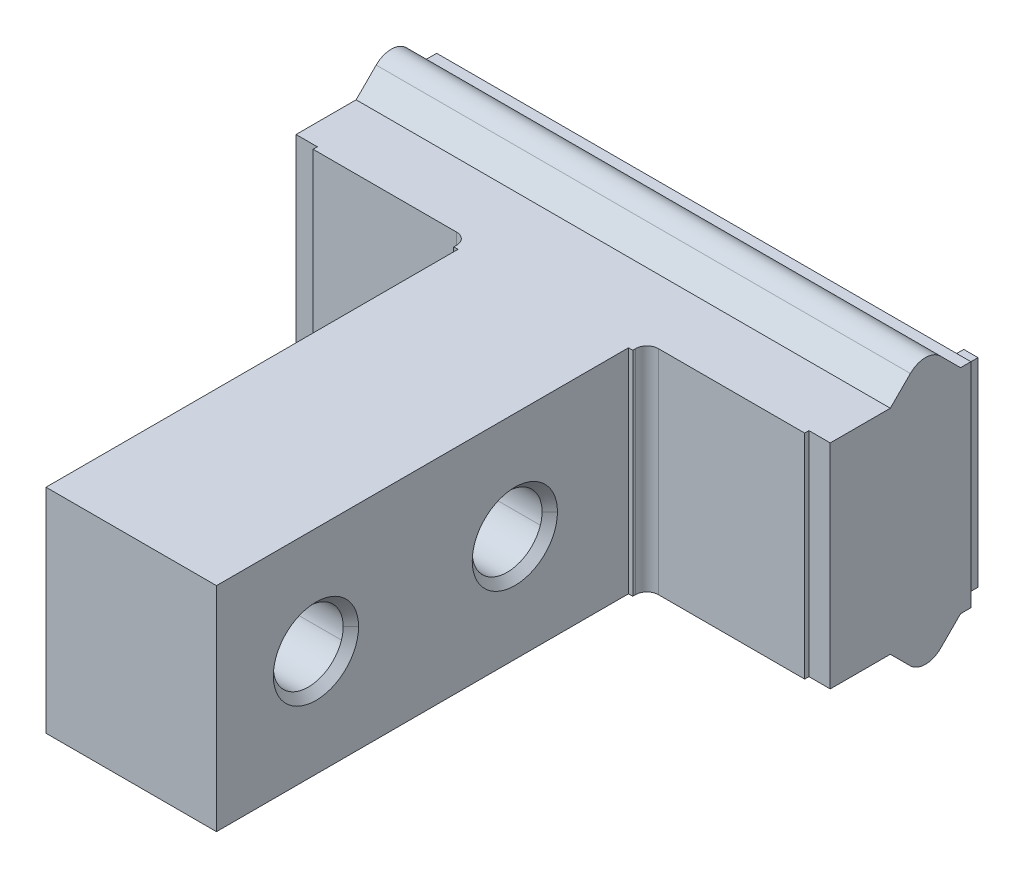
ISO-10303-21;
HEADER;
FILE_DESCRIPTION(('STEP AP214'),'2;1');
FILE_NAME('part.step','',(''),(''),'','','');
FILE_SCHEMA(('AUTOMOTIVE_DESIGN { 1 0 10303 214 1 1 1 1 }'));
ENDSEC;
DATA;
#1=APPLICATION_CONTEXT('core data for automotive mechanical design processes');
#2=APPLICATION_PROTOCOL_DEFINITION('international standard','automotive_design',2000,#1);
#3=PRODUCT_CONTEXT('',#1,'mechanical');
#4=PRODUCT('Part','Part','',(#3));
#5=PRODUCT_RELATED_PRODUCT_CATEGORY('part','',(#4));
#6=PRODUCT_DEFINITION_FORMATION('','',#4);
#7=PRODUCT_DEFINITION_CONTEXT('part definition',#1,'design');
#8=PRODUCT_DEFINITION('design','',#6,#7);
#9=PRODUCT_DEFINITION_SHAPE('','',#8);
#10=(LENGTH_UNIT() NAMED_UNIT(*) SI_UNIT(.MILLI.,.METRE.));
#11=(NAMED_UNIT(*) PLANE_ANGLE_UNIT() SI_UNIT($,.RADIAN.));
#12=(NAMED_UNIT(*) SI_UNIT($,.STERADIAN.) SOLID_ANGLE_UNIT());
#13=UNCERTAINTY_MEASURE_WITH_UNIT(LENGTH_MEASURE(1.E-05),#10,'distance_accuracy_value','');
#14=(GEOMETRIC_REPRESENTATION_CONTEXT(3) GLOBAL_UNCERTAINTY_ASSIGNED_CONTEXT((#13)) GLOBAL_UNIT_ASSIGNED_CONTEXT((#10,
#11,#12)) REPRESENTATION_CONTEXT('',''));
#15=CARTESIAN_POINT('',(0.,0.,0.));
#16=DIRECTION('',(0.,0.,1.));
#17=DIRECTION('',(1.,0.,0.));
#18=AXIS2_PLACEMENT_3D('',#15,#16,#17);
#19=CARTESIAN_POINT('',(-37.1000000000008,7.5,11.0000000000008));
#20=DIRECTION('',(0.,1.,0.));
#21=DIRECTION('',(0.,0.,1.));
#22=AXIS2_PLACEMENT_3D('',#19,#20,#21);
#23=PLANE('',#22);
#24=DIRECTION('',(-1.,0.,0.));
#25=VECTOR('',#24,1.);
#26=CARTESIAN_POINT('',(-11.1,7.5,9.9));
#27=LINE('',#26,#25);
#28=CARTESIAN_POINT('',(-47.2,7.5,9.9));
#29=VERTEX_POINT('',#28);
#30=CARTESIAN_POINT('',(-48.7,7.5,9.9));
#31=VERTEX_POINT('',#30);
#32=EDGE_CURVE('E11',#29,#31,#27,.T.);
#33=ORIENTED_EDGE('',*,*,#32,.F.);
#34=DIRECTION('',(0.,0.,1.));
#35=VECTOR('',#34,1.);
#36=CARTESIAN_POINT('',(-47.2,7.5,11.0000000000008));
#37=LINE('',#36,#35);
#38=CARTESIAN_POINT('',(-47.2,7.5,10.2));
#39=VERTEX_POINT('',#38);
#40=EDGE_CURVE('E25',#29,#39,#37,.T.);
#41=ORIENTED_EDGE('',*,*,#40,.T.);
#42=DIRECTION('',(1.,0.,0.));
#43=VECTOR('',#42,1.);
#44=CARTESIAN_POINT('',(-48.7,7.5,10.2));
#45=LINE('',#44,#43);
#46=CARTESIAN_POINT('',(-37.1,7.5,10.2));
#47=VERTEX_POINT('',#46);
#48=EDGE_CURVE('E831',#39,#47,#45,.T.);
#49=ORIENTED_EDGE('',*,*,#48,.T.);
#50=CARTESIAN_POINT('',(-37.1000000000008,7.5,11.0000000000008));
#51=DIRECTION('',(0.,1.,0.));
#52=DIRECTION('',(1.,0.,0.));
#53=AXIS2_PLACEMENT_3D('',#50,#51,#52);
#54=CIRCLE('',#53,0.800000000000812);
#55=CARTESIAN_POINT('',(-36.3,7.5,11.));
#56=VERTEX_POINT('',#55);
#57=EDGE_CURVE('E826',#56,#47,#54,.T.);
#58=ORIENTED_EDGE('',*,*,#57,.F.);
#59=DIRECTION('',(0.,0.,1.));
#60=VECTOR('',#59,1.);
#61=CARTESIAN_POINT('',(-36.3,7.5,11.));
#62=LINE('',#61,#60);
#63=CARTESIAN_POINT('',(-36.3,7.5,11.2));
#64=VERTEX_POINT('',#63);
#65=EDGE_CURVE('E822',#56,#64,#62,.T.);
#66=ORIENTED_EDGE('',*,*,#65,.T.);
#67=DIRECTION('',(1.,0.,0.));
#68=VECTOR('',#67,1.);
#69=CARTESIAN_POINT('',(-36.3,7.5,11.2));
#70=LINE('',#69,#68);
#71=CARTESIAN_POINT('',(-36.,7.5,11.2));
#72=VERTEX_POINT('',#71);
#73=EDGE_CURVE('E818',#64,#72,#70,.T.);
#74=ORIENTED_EDGE('',*,*,#73,.T.);
#75=DIRECTION('',(0.,0.,1.));
#76=VECTOR('',#75,1.);
#77=CARTESIAN_POINT('',(-36.,7.5,11.2));
#78=LINE('',#77,#76);
#79=CARTESIAN_POINT('',(-36.,7.5,40.2));
#80=VERTEX_POINT('',#79);
#81=EDGE_CURVE('E814',#72,#80,#78,.T.);
#82=ORIENTED_EDGE('',*,*,#81,.T.);
#83=DIRECTION('',(1.,0.,0.));
#84=VECTOR('',#83,1.);
#85=CARTESIAN_POINT('',(-36.,7.5,40.2));
#86=LINE('',#85,#84);
#87=CARTESIAN_POINT('',(-24.,7.5,40.2));
#88=VERTEX_POINT('',#87);
#89=EDGE_CURVE('E810',#80,#88,#86,.T.);
#90=ORIENTED_EDGE('',*,*,#89,.T.);
#91=DIRECTION('',(0.,0.,-1.));
#92=VECTOR('',#91,1.);
#93=CARTESIAN_POINT('',(-24.,7.5,40.2));
#94=LINE('',#93,#92);
#95=CARTESIAN_POINT('',(-24.,7.5,11.2));
#96=VERTEX_POINT('',#95);
#97=EDGE_CURVE('E806',#88,#96,#94,.T.);
#98=ORIENTED_EDGE('',*,*,#97,.T.);
#99=DIRECTION('',(1.,0.,0.));
#100=VECTOR('',#99,1.);
#101=CARTESIAN_POINT('',(-24.,7.5,11.2));
#102=LINE('',#101,#100);
#103=CARTESIAN_POINT('',(-23.7,7.5,11.2));
#104=VERTEX_POINT('',#103);
#105=EDGE_CURVE('E802',#96,#104,#102,.T.);
#106=ORIENTED_EDGE('',*,*,#105,.T.);
#107=DIRECTION('',(0.,0.,-1.));
#108=VECTOR('',#107,1.);
#109=CARTESIAN_POINT('',(-23.7,7.5,11.2));
#110=LINE('',#109,#108);
#111=CARTESIAN_POINT('',(-23.7,7.5,11.));
#112=VERTEX_POINT('',#111);
#113=EDGE_CURVE('E798',#104,#112,#110,.T.);
#114=ORIENTED_EDGE('',*,*,#113,.T.);
#115=CARTESIAN_POINT('',(-22.8999999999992,7.5,11.0000000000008));
#116=DIRECTION('',(0.,1.,0.));
#117=DIRECTION('',(1.,0.,0.));
#118=AXIS2_PLACEMENT_3D('',#115,#116,#117);
#119=CIRCLE('',#118,0.800000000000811);
#120=CARTESIAN_POINT('',(-22.9,7.5,10.2));
#121=VERTEX_POINT('',#120);
#122=EDGE_CURVE('E793',#121,#112,#119,.T.);
#123=ORIENTED_EDGE('',*,*,#122,.F.);
#124=DIRECTION('',(1.,0.,0.));
#125=VECTOR('',#124,1.);
#126=CARTESIAN_POINT('',(-22.9,7.5,10.2));
#127=LINE('',#126,#125);
#128=CARTESIAN_POINT('',(-12.6,7.5,10.2));
#129=VERTEX_POINT('',#128);
#130=EDGE_CURVE('E789',#121,#129,#127,.T.);
#131=ORIENTED_EDGE('',*,*,#130,.T.);
#132=DIRECTION('',(0.,0.,-1.));
#133=VECTOR('',#132,1.);
#134=CARTESIAN_POINT('',(-12.6,7.5,11.0000000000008));
#135=LINE('',#134,#133);
#136=CARTESIAN_POINT('',(-12.6,7.5,9.9));
#137=VERTEX_POINT('',#136);
#138=EDGE_CURVE('E785',#129,#137,#135,.T.);
#139=ORIENTED_EDGE('',*,*,#138,.T.);
#140=DIRECTION('',(-1.,0.,0.));
#141=VECTOR('',#140,1.);
#142=CARTESIAN_POINT('',(-11.1,7.5,9.9));
#143=LINE('',#142,#141);
#144=CARTESIAN_POINT('',(-11.1,7.5,9.9));
#145=VERTEX_POINT('',#144);
#146=EDGE_CURVE('E780',#145,#137,#143,.T.);
#147=ORIENTED_EDGE('',*,*,#146,.F.);
#148=DIRECTION('',(0.,0.,1.));
#149=VECTOR('',#148,1.);
#150=CARTESIAN_POINT('',(-11.1,7.5,5.6723));
#151=LINE('',#150,#149);
#152=CARTESIAN_POINT('',(-11.1,7.5,5.6723));
#153=VERTEX_POINT('',#152);
#154=EDGE_CURVE('E775',#153,#145,#151,.T.);
#155=ORIENTED_EDGE('',*,*,#154,.F.);
#156=DIRECTION('',(-1.,0.,0.));
#157=VECTOR('',#156,1.);
#158=CARTESIAN_POINT('',(-11.1,7.5,5.6723));
#159=LINE('',#158,#157);
#160=CARTESIAN_POINT('',(-48.7,7.5,5.6723));
#161=VERTEX_POINT('',#160);
#162=EDGE_CURVE('E771',#153,#161,#159,.T.);
#163=ORIENTED_EDGE('',*,*,#162,.T.);
#164=DIRECTION('',(0.,0.,1.));
#165=VECTOR('',#164,1.);
#166=CARTESIAN_POINT('',(-48.7,7.5,5.6723));
#167=LINE('',#166,#165);
#168=EDGE_CURVE('E767',#161,#31,#167,.T.);
#169=ORIENTED_EDGE('',*,*,#168,.T.);
#170=EDGE_LOOP('',(#33,#41,#49,#58,#66,#74,#82,#90,#98,#106,#114,#123,#131,#139,#147,#155,#163,#169));
#171=FACE_BOUND('',#170,.T.);
#172=ADVANCED_FACE('F17',(#171),#23,.T.);
#173=CARTESIAN_POINT('',(-48.7,-7.85,3.1995));
#174=DIRECTION('',(1.,0.,0.));
#175=DIRECTION('',(0.,0.,-1.));
#176=AXIS2_PLACEMENT_3D('',#173,#174,#175);
#177=PLANE('',#176);
#178=ORIENTED_EDGE('',*,*,#168,.F.);
#179=DIRECTION('',(0.,-0.706736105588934,0.707477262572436));
#180=VECTOR('',#179,1.);
#181=CARTESIAN_POINT('',(-48.7,8.9112158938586,4.2596041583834));
#182=LINE('',#181,#180);
#183=CARTESIAN_POINT('',(-48.7,8.9112158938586,4.2596041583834));
#184=VERTEX_POINT('',#183);
#185=EDGE_CURVE('E762',#184,#161,#182,.T.);
#186=ORIENTED_EDGE('',*,*,#185,.F.);
#187=CARTESIAN_POINT('',(-48.7,7.85,3.1995));
#188=DIRECTION('',(1.,0.,0.));
#189=DIRECTION('',(0.,0.,-1.));
#190=AXIS2_PLACEMENT_3D('',#187,#188,#189);
#191=CIRCLE('',#190,1.49999999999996);
#192=CARTESIAN_POINT('',(-48.7,8.9106901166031,2.1388697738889));
#193=VERTEX_POINT('',#192);
#194=EDGE_CURVE('E757',#193,#184,#191,.T.);
#195=ORIENTED_EDGE('',*,*,#194,.F.);
#196=DIRECTION('',(0.,0.707086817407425,0.707126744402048));
#197=VECTOR('',#196,1.);
#198=CARTESIAN_POINT('',(-48.7,7.5,0.7281));
#199=LINE('',#198,#197);
#200=CARTESIAN_POINT('',(-48.7,7.5,0.7281));
#201=VERTEX_POINT('',#200);
#202=EDGE_CURVE('E752',#201,#193,#199,.T.);
#203=ORIENTED_EDGE('',*,*,#202,.F.);
#204=DIRECTION('',(0.,0.,1.));
#205=VECTOR('',#204,1.);
#206=CARTESIAN_POINT('',(-48.7,7.5,0.));
#207=LINE('',#206,#205);
#208=CARTESIAN_POINT('',(-48.7,7.5,0.));
#209=VERTEX_POINT('',#208);
#210=EDGE_CURVE('E747',#209,#201,#207,.T.);
#211=ORIENTED_EDGE('',*,*,#210,.F.);
#212=DIRECTION('',(0.,1.,0.));
#213=VECTOR('',#212,1.);
#214=CARTESIAN_POINT('',(-48.7,-7.5,0.));
#215=LINE('',#214,#213);
#216=CARTESIAN_POINT('',(-48.7,-7.5,0.));
#217=VERTEX_POINT('',#216);
#218=EDGE_CURVE('E742',#217,#209,#215,.T.);
#219=ORIENTED_EDGE('',*,*,#218,.F.);
#220=DIRECTION('',(0.,0.,-1.));
#221=VECTOR('',#220,1.);
#222=CARTESIAN_POINT('',(-48.7,-7.5,0.72809999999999));
#223=LINE('',#222,#221);
#224=CARTESIAN_POINT('',(-48.7,-7.5,0.72809999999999));
#225=VERTEX_POINT('',#224);
#226=EDGE_CURVE('E737',#225,#217,#223,.T.);
#227=ORIENTED_EDGE('',*,*,#226,.F.);
#228=DIRECTION('',(0.,0.707086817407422,-0.70712674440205));
#229=VECTOR('',#228,1.);
#230=CARTESIAN_POINT('',(-48.7,-8.9106901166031,2.1388697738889));
#231=LINE('',#230,#229);
#232=CARTESIAN_POINT('',(-48.7,-8.9106901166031,2.1388697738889));
#233=VERTEX_POINT('',#232);
#234=EDGE_CURVE('E732',#233,#225,#231,.T.);
#235=ORIENTED_EDGE('',*,*,#234,.F.);
#236=CARTESIAN_POINT('',(-48.7,-7.85,3.1995));
#237=DIRECTION('',(1.,0.,0.));
#238=DIRECTION('',(0.,0.,-1.));
#239=AXIS2_PLACEMENT_3D('',#236,#237,#238);
#240=CIRCLE('',#239,1.49999999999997);
#241=CARTESIAN_POINT('',(-48.7,-8.9112158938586,4.2596041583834));
#242=VERTEX_POINT('',#241);
#243=EDGE_CURVE('E727',#242,#233,#240,.T.);
#244=ORIENTED_EDGE('',*,*,#243,.F.);
#245=DIRECTION('',(0.,-0.706736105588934,-0.707477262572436));
#246=VECTOR('',#245,1.);
#247=CARTESIAN_POINT('',(-48.7,-7.5,5.6723));
#248=LINE('',#247,#246);
#249=CARTESIAN_POINT('',(-48.7,-7.5,5.6723));
#250=VERTEX_POINT('',#249);
#251=EDGE_CURVE('E722',#250,#242,#248,.T.);
#252=ORIENTED_EDGE('',*,*,#251,.F.);
#253=DIRECTION('',(0.,0.,-1.));
#254=VECTOR('',#253,1.);
#255=CARTESIAN_POINT('',(-48.7,-7.5,9.9));
#256=LINE('',#255,#254);
#257=CARTESIAN_POINT('',(-48.7,-7.5,9.9));
#258=VERTEX_POINT('',#257);
#259=EDGE_CURVE('E717',#258,#250,#256,.T.);
#260=ORIENTED_EDGE('',*,*,#259,.F.);
#261=DIRECTION('',(0.,-1.,0.));
#262=VECTOR('',#261,1.);
#263=CARTESIAN_POINT('',(-48.7,7.5,9.9));
#264=LINE('',#263,#262);
#265=EDGE_CURVE('E712',#31,#258,#264,.T.);
#266=ORIENTED_EDGE('',*,*,#265,.F.);
#267=EDGE_LOOP('',(#178,#186,#195,#203,#211,#219,#227,#235,#244,#252,#260,#266));
#268=FACE_BOUND('',#267,.T.);
#269=ADVANCED_FACE('F903',(#268),#177,.F.);
#270=CARTESIAN_POINT('',(-11.1,7.5,9.9));
#271=DIRECTION('',(0.,0.,-1.));
#272=DIRECTION('',(-1.,0.,0.));
#273=AXIS2_PLACEMENT_3D('',#270,#271,#272);
#274=PLANE('',#273);
#275=DIRECTION('',(0.,-1.,0.));
#276=VECTOR('',#275,1.);
#277=CARTESIAN_POINT('',(-47.2,50.,9.9));
#278=LINE('',#277,#276);
#279=CARTESIAN_POINT('',(-47.2,-7.5,9.9));
#280=VERTEX_POINT('',#279);
#281=EDGE_CURVE('E707',#29,#280,#278,.T.);
#282=ORIENTED_EDGE('',*,*,#281,.F.);
#283=ORIENTED_EDGE('',*,*,#32,.T.);
#284=ORIENTED_EDGE('',*,*,#265,.T.);
#285=DIRECTION('',(-1.,0.,0.));
#286=VECTOR('',#285,1.);
#287=CARTESIAN_POINT('',(-11.1,-7.5,9.9));
#288=LINE('',#287,#286);
#289=EDGE_CURVE('E702',#280,#258,#288,.T.);
#290=ORIENTED_EDGE('',*,*,#289,.F.);
#291=EDGE_LOOP('',(#282,#283,#284,#290));
#292=FACE_BOUND('',#291,.T.);
#293=ADVANCED_FACE('F905',(#292),#274,.F.);
#294=CARTESIAN_POINT('',(-37.1000000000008,-7.5,11.0000000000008));
#295=DIRECTION('',(0.,1.,0.));
#296=DIRECTION('',(0.,0.,1.));
#297=AXIS2_PLACEMENT_3D('',#294,#295,#296);
#298=PLANE('',#297);
#299=ORIENTED_EDGE('',*,*,#259,.T.);
#300=DIRECTION('',(-1.,0.,0.));
#301=VECTOR('',#300,1.);
#302=CARTESIAN_POINT('',(-11.1,-7.5,5.6723));
#303=LINE('',#302,#301);
#304=CARTESIAN_POINT('',(-11.1,-7.5,5.6723));
#305=VERTEX_POINT('',#304);
#306=EDGE_CURVE('E697',#305,#250,#303,.T.);
#307=ORIENTED_EDGE('',*,*,#306,.F.);
#308=DIRECTION('',(0.,0.,-1.));
#309=VECTOR('',#308,1.);
#310=CARTESIAN_POINT('',(-11.1,-7.5,9.9));
#311=LINE('',#310,#309);
#312=CARTESIAN_POINT('',(-11.1,-7.5,9.9));
#313=VERTEX_POINT('',#312);
#314=EDGE_CURVE('E692',#313,#305,#311,.T.);
#315=ORIENTED_EDGE('',*,*,#314,.F.);
#316=DIRECTION('',(-1.,0.,0.));
#317=VECTOR('',#316,1.);
#318=CARTESIAN_POINT('',(-11.1,-7.5,9.9));
#319=LINE('',#318,#317);
#320=CARTESIAN_POINT('',(-12.6,-7.5,9.9));
#321=VERTEX_POINT('',#320);
#322=EDGE_CURVE('E688',#313,#321,#319,.T.);
#323=ORIENTED_EDGE('',*,*,#322,.T.);
#324=DIRECTION('',(0.,0.,-1.));
#325=VECTOR('',#324,1.);
#326=CARTESIAN_POINT('',(-12.6,-7.5,11.0000000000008));
#327=LINE('',#326,#325);
#328=CARTESIAN_POINT('',(-12.6,-7.5,10.2));
#329=VERTEX_POINT('',#328);
#330=EDGE_CURVE('E683',#329,#321,#327,.T.);
#331=ORIENTED_EDGE('',*,*,#330,.F.);
#332=DIRECTION('',(1.,0.,0.));
#333=VECTOR('',#332,1.);
#334=CARTESIAN_POINT('',(-22.9,-7.5,10.2));
#335=LINE('',#334,#333);
#336=CARTESIAN_POINT('',(-22.9,-7.5,10.2));
#337=VERTEX_POINT('',#336);
#338=EDGE_CURVE('E678',#337,#329,#335,.T.);
#339=ORIENTED_EDGE('',*,*,#338,.F.);
#340=CARTESIAN_POINT('',(-22.8999999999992,-7.5,11.0000000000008));
#341=DIRECTION('',(0.,1.,0.));
#342=DIRECTION('',(1.,0.,0.));
#343=AXIS2_PLACEMENT_3D('',#340,#341,#342);
#344=CIRCLE('',#343,0.800000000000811);
#345=CARTESIAN_POINT('',(-23.7,-7.5,11.));
#346=VERTEX_POINT('',#345);
#347=EDGE_CURVE('E674',#337,#346,#344,.T.);
#348=ORIENTED_EDGE('',*,*,#347,.T.);
#349=DIRECTION('',(0.,0.,-1.));
#350=VECTOR('',#349,1.);
#351=CARTESIAN_POINT('',(-23.7,-7.5,11.2));
#352=LINE('',#351,#350);
#353=CARTESIAN_POINT('',(-23.7,-7.5,11.2));
#354=VERTEX_POINT('',#353);
#355=EDGE_CURVE('E669',#354,#346,#352,.T.);
#356=ORIENTED_EDGE('',*,*,#355,.F.);
#357=DIRECTION('',(1.,0.,0.));
#358=VECTOR('',#357,1.);
#359=CARTESIAN_POINT('',(-24.,-7.5,11.2));
#360=LINE('',#359,#358);
#361=CARTESIAN_POINT('',(-24.,-7.5,11.2));
#362=VERTEX_POINT('',#361);
#363=EDGE_CURVE('E664',#362,#354,#360,.T.);
#364=ORIENTED_EDGE('',*,*,#363,.F.);
#365=DIRECTION('',(0.,0.,-1.));
#366=VECTOR('',#365,1.);
#367=CARTESIAN_POINT('',(-24.,-7.5,40.2));
#368=LINE('',#367,#366);
#369=CARTESIAN_POINT('',(-24.,-7.5,40.2));
#370=VERTEX_POINT('',#369);
#371=EDGE_CURVE('E659',#370,#362,#368,.T.);
#372=ORIENTED_EDGE('',*,*,#371,.F.);
#373=DIRECTION('',(1.,0.,0.));
#374=VECTOR('',#373,1.);
#375=CARTESIAN_POINT('',(-36.,-7.5,40.2));
#376=LINE('',#375,#374);
#377=CARTESIAN_POINT('',(-36.,-7.5,40.2));
#378=VERTEX_POINT('',#377);
#379=EDGE_CURVE('E654',#378,#370,#376,.T.);
#380=ORIENTED_EDGE('',*,*,#379,.F.);
#381=DIRECTION('',(0.,0.,1.));
#382=VECTOR('',#381,1.);
#383=CARTESIAN_POINT('',(-36.,-7.5,11.2));
#384=LINE('',#383,#382);
#385=CARTESIAN_POINT('',(-36.,-7.5,11.2));
#386=VERTEX_POINT('',#385);
#387=EDGE_CURVE('E649',#386,#378,#384,.T.);
#388=ORIENTED_EDGE('',*,*,#387,.F.);
#389=DIRECTION('',(1.,0.,0.));
#390=VECTOR('',#389,1.);
#391=CARTESIAN_POINT('',(-36.3,-7.5,11.2));
#392=LINE('',#391,#390);
#393=CARTESIAN_POINT('',(-36.3,-7.5,11.2));
#394=VERTEX_POINT('',#393);
#395=EDGE_CURVE('E644',#394,#386,#392,.T.);
#396=ORIENTED_EDGE('',*,*,#395,.F.);
#397=DIRECTION('',(0.,0.,1.));
#398=VECTOR('',#397,1.);
#399=CARTESIAN_POINT('',(-36.3,-7.5,11.));
#400=LINE('',#399,#398);
#401=CARTESIAN_POINT('',(-36.3,-7.5,11.));
#402=VERTEX_POINT('',#401);
#403=EDGE_CURVE('E639',#402,#394,#400,.T.);
#404=ORIENTED_EDGE('',*,*,#403,.F.);
#405=CARTESIAN_POINT('',(-37.1000000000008,-7.5,11.0000000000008));
#406=DIRECTION('',(0.,1.,0.));
#407=DIRECTION('',(1.,0.,0.));
#408=AXIS2_PLACEMENT_3D('',#405,#406,#407);
#409=CIRCLE('',#408,0.800000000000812);
#410=CARTESIAN_POINT('',(-37.1,-7.5,10.2));
#411=VERTEX_POINT('',#410);
#412=EDGE_CURVE('E635',#402,#411,#409,.T.);
#413=ORIENTED_EDGE('',*,*,#412,.T.);
#414=DIRECTION('',(1.,0.,0.));
#415=VECTOR('',#414,1.);
#416=CARTESIAN_POINT('',(-48.7,-7.5,10.2));
#417=LINE('',#416,#415);
#418=CARTESIAN_POINT('',(-47.2,-7.5,10.2));
#419=VERTEX_POINT('',#418);
#420=EDGE_CURVE('E630',#419,#411,#417,.T.);
#421=ORIENTED_EDGE('',*,*,#420,.F.);
#422=DIRECTION('',(0.,0.,1.));
#423=VECTOR('',#422,1.);
#424=CARTESIAN_POINT('',(-47.2,-7.5,11.0000000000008));
#425=LINE('',#424,#423);
#426=EDGE_CURVE('E625',#280,#419,#425,.T.);
#427=ORIENTED_EDGE('',*,*,#426,.F.);
#428=ORIENTED_EDGE('',*,*,#289,.T.);
#429=EDGE_LOOP('',(#299,#307,#315,#323,#331,#339,#348,#356,#364,#372,#380,#388,#396,#404,#413,
#421,#427,#428));
#430=FACE_BOUND('',#429,.T.);
#431=ADVANCED_FACE('F910',(#430),#298,.F.);
#432=CARTESIAN_POINT('',(-47.2,50.,30.));
#433=DIRECTION('',(-1.,0.,0.));
#434=DIRECTION('',(0.,0.,1.));
#435=AXIS2_PLACEMENT_3D('',#432,#433,#434);
#436=PLANE('',#435);
#437=ORIENTED_EDGE('',*,*,#40,.F.);
#438=ORIENTED_EDGE('',*,*,#281,.T.);
#439=ORIENTED_EDGE('',*,*,#426,.T.);
#440=DIRECTION('',(0.,1.,0.));
#441=VECTOR('',#440,1.);
#442=CARTESIAN_POINT('',(-47.2,7.5,10.2));
#443=LINE('',#442,#441);
#444=EDGE_CURVE('E621',#419,#39,#443,.T.);
#445=ORIENTED_EDGE('',*,*,#444,.T.);
#446=EDGE_LOOP('',(#437,#438,#439,#445));
#447=FACE_BOUND('',#446,.T.);
#448=ADVANCED_FACE('F908',(#447),#436,.T.);
#449=CARTESIAN_POINT('',(-48.7,7.5,10.2));
#450=DIRECTION('',(0.,0.,-1.));
#451=DIRECTION('',(-1.,0.,0.));
#452=AXIS2_PLACEMENT_3D('',#449,#450,#451);
#453=PLANE('',#452);
#454=ORIENTED_EDGE('',*,*,#444,.F.);
#455=ORIENTED_EDGE('',*,*,#420,.T.);
#456=DIRECTION('',(0.,-1.,0.));
#457=VECTOR('',#456,1.);
#458=CARTESIAN_POINT('',(-37.1,7.5,10.2));
#459=LINE('',#458,#457);
#460=EDGE_CURVE('E616',#47,#411,#459,.T.);
#461=ORIENTED_EDGE('',*,*,#460,.F.);
#462=ORIENTED_EDGE('',*,*,#48,.F.);
#463=EDGE_LOOP('',(#454,#455,#461,#462));
#464=FACE_BOUND('',#463,.T.);
#465=ADVANCED_FACE('F844',(#464),#453,.F.);
#466=CARTESIAN_POINT('',(-37.1000000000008,7.5,11.0000000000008));
#467=DIRECTION('',(0.,-1.,0.));
#468=DIRECTION('',(-0.707106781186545,0.,0.70710678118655));
#469=AXIS2_PLACEMENT_3D('',#466,#467,#468);
#470=CYLINDRICAL_SURFACE('',#469,0.800000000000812);
#471=ORIENTED_EDGE('',*,*,#412,.F.);
#472=DIRECTION('',(0.,-1.,0.));
#473=VECTOR('',#472,1.);
#474=CARTESIAN_POINT('',(-36.3,7.5,11.));
#475=LINE('',#474,#473);
#476=EDGE_CURVE('E611',#56,#402,#475,.T.);
#477=ORIENTED_EDGE('',*,*,#476,.F.);
#478=ORIENTED_EDGE('',*,*,#57,.T.);
#479=ORIENTED_EDGE('',*,*,#460,.T.);
#480=EDGE_LOOP('',(#471,#477,#478,#479));
#481=FACE_BOUND('',#480,.T.);
#482=ADVANCED_FACE('F847',(#481),#470,.F.);
#483=CARTESIAN_POINT('',(-36.3,7.5,11.));
#484=DIRECTION('',(1.,0.,0.));
#485=DIRECTION('',(0.,0.,-1.));
#486=AXIS2_PLACEMENT_3D('',#483,#484,#485);
#487=PLANE('',#486);
#488=ORIENTED_EDGE('',*,*,#403,.T.);
#489=DIRECTION('',(0.,-1.,0.));
#490=VECTOR('',#489,1.);
#491=CARTESIAN_POINT('',(-36.3,7.5,11.2));
#492=LINE('',#491,#490);
#493=EDGE_CURVE('E606',#64,#394,#492,.T.);
#494=ORIENTED_EDGE('',*,*,#493,.F.);
#495=ORIENTED_EDGE('',*,*,#65,.F.);
#496=ORIENTED_EDGE('',*,*,#476,.T.);
#497=EDGE_LOOP('',(#488,#494,#495,#496));
#498=FACE_BOUND('',#497,.T.);
#499=ADVANCED_FACE('F851',(#498),#487,.F.);
#500=CARTESIAN_POINT('',(-36.3,7.5,11.2));
#501=DIRECTION('',(0.,0.,-1.));
#502=DIRECTION('',(-1.,0.,0.));
#503=AXIS2_PLACEMENT_3D('',#500,#501,#502);
#504=PLANE('',#503);
#505=ORIENTED_EDGE('',*,*,#395,.T.);
#506=DIRECTION('',(0.,-1.,0.));
#507=VECTOR('',#506,1.);
#508=CARTESIAN_POINT('',(-36.,7.5,11.2));
#509=LINE('',#508,#507);
#510=EDGE_CURVE('E601',#72,#386,#509,.T.);
#511=ORIENTED_EDGE('',*,*,#510,.F.);
#512=ORIENTED_EDGE('',*,*,#73,.F.);
#513=ORIENTED_EDGE('',*,*,#493,.T.);
#514=EDGE_LOOP('',(#505,#511,#512,#513));
#515=FACE_BOUND('',#514,.T.);
#516=ADVANCED_FACE('F857',(#515),#504,.F.);
#517=CARTESIAN_POINT('',(-36.,7.5,11.2));
#518=DIRECTION('',(1.,0.,0.));
#519=DIRECTION('',(0.,0.,-1.));
#520=AXIS2_PLACEMENT_3D('',#517,#518,#519);
#521=PLANE('',#520);
#522=CARTESIAN_POINT('',(-36.,0.,19.2));
#523=DIRECTION('',(-1.,0.,0.));
#524=DIRECTION('',(0.,0.,1.));
#525=AXIS2_PLACEMENT_3D('',#522,#523,#524);
#526=CIRCLE('',#525,3.);
#527=CARTESIAN_POINT('',(-36.,0.,16.2));
#528=VERTEX_POINT('',#527);
#529=CARTESIAN_POINT('',(-36.,0.,22.2));
#530=VERTEX_POINT('',#529);
#531=EDGE_CURVE('E597',#528,#530,#526,.T.);
#532=ORIENTED_EDGE('',*,*,#531,.F.);
#533=CARTESIAN_POINT('',(-36.,0.,19.2));
#534=DIRECTION('',(-1.,0.,0.));
#535=DIRECTION('',(0.,0.,1.));
#536=AXIS2_PLACEMENT_3D('',#533,#534,#535);
#537=CIRCLE('',#536,3.);
#538=EDGE_CURVE('E289',#530,#528,#537,.T.);
#539=ORIENTED_EDGE('',*,*,#538,.F.);
#540=EDGE_LOOP('',(#532,#539));
#541=FACE_BOUND('',#540,.T.);
#542=CARTESIAN_POINT('',(-36.,0.,33.2));
#543=DIRECTION('',(-1.,0.,0.));
#544=DIRECTION('',(0.,0.,1.));
#545=AXIS2_PLACEMENT_3D('',#542,#543,#544);
#546=CIRCLE('',#545,3.);
#547=CARTESIAN_POINT('',(-36.,0.,30.2));
#548=VERTEX_POINT('',#547);
#549=CARTESIAN_POINT('',(-36.,0.,36.2));
#550=VERTEX_POINT('',#549);
#551=EDGE_CURVE('E589',#548,#550,#546,.T.);
#552=ORIENTED_EDGE('',*,*,#551,.F.);
#553=CARTESIAN_POINT('',(-36.,0.,33.2));
#554=DIRECTION('',(-1.,0.,0.));
#555=DIRECTION('',(0.,0.,1.));
#556=AXIS2_PLACEMENT_3D('',#553,#554,#555);
#557=CIRCLE('',#556,3.);
#558=EDGE_CURVE('E584',#550,#548,#557,.T.);
#559=ORIENTED_EDGE('',*,*,#558,.F.);
#560=EDGE_LOOP('',(#552,#559));
#561=FACE_BOUND('',#560,.T.);
#562=ORIENTED_EDGE('',*,*,#387,.T.);
#563=DIRECTION('',(0.,-1.,0.));
#564=VECTOR('',#563,1.);
#565=CARTESIAN_POINT('',(-36.,7.5,40.2));
#566=LINE('',#565,#564);
#567=EDGE_CURVE('E579',#80,#378,#566,.T.);
#568=ORIENTED_EDGE('',*,*,#567,.F.);
#569=ORIENTED_EDGE('',*,*,#81,.F.);
#570=ORIENTED_EDGE('',*,*,#510,.T.);
#571=EDGE_LOOP('',(#562,#568,#569,#570));
#572=FACE_BOUND('',#571,.T.);
#573=ADVANCED_FACE('F859',(#541,#561,#572),#521,.F.);
#574=CARTESIAN_POINT('',(-36.,7.5,40.2));
#575=DIRECTION('',(0.,0.,-1.));
#576=DIRECTION('',(-1.,0.,0.));
#577=AXIS2_PLACEMENT_3D('',#574,#575,#576);
#578=PLANE('',#577);
#579=ORIENTED_EDGE('',*,*,#379,.T.);
#580=DIRECTION('',(0.,-1.,0.));
#581=VECTOR('',#580,1.);
#582=CARTESIAN_POINT('',(-24.,7.5,40.2));
#583=LINE('',#582,#581);
#584=EDGE_CURVE('E574',#88,#370,#583,.T.);
#585=ORIENTED_EDGE('',*,*,#584,.F.);
#586=ORIENTED_EDGE('',*,*,#89,.F.);
#587=ORIENTED_EDGE('',*,*,#567,.T.);
#588=EDGE_LOOP('',(#579,#585,#586,#587));
#589=FACE_BOUND('',#588,.T.);
#590=ADVANCED_FACE('F863',(#589),#578,.F.);
#591=CARTESIAN_POINT('',(-24.,7.5,40.2));
#592=DIRECTION('',(-1.,0.,0.));
#593=DIRECTION('',(0.,0.,1.));
#594=AXIS2_PLACEMENT_3D('',#591,#592,#593);
#595=PLANE('',#594);
#596=CARTESIAN_POINT('',(-24.,0.,19.2));
#597=DIRECTION('',(-1.,0.,0.));
#598=DIRECTION('',(0.,0.,1.));
#599=AXIS2_PLACEMENT_3D('',#596,#597,#598);
#600=CIRCLE('',#599,3.);
#601=CARTESIAN_POINT('',(-24.,0.,22.2));
#602=VERTEX_POINT('',#601);
#603=CARTESIAN_POINT('',(-24.,0.,16.2));
#604=VERTEX_POINT('',#603);
#605=EDGE_CURVE('E570',#602,#604,#600,.T.);
#606=ORIENTED_EDGE('',*,*,#605,.T.);
#607=CARTESIAN_POINT('',(-24.,0.,19.2));
#608=DIRECTION('',(-1.,0.,0.));
#609=DIRECTION('',(0.,0.,1.));
#610=AXIS2_PLACEMENT_3D('',#607,#608,#609);
#611=CIRCLE('',#610,3.);
#612=EDGE_CURVE('E566',#604,#602,#611,.T.);
#613=ORIENTED_EDGE('',*,*,#612,.T.);
#614=EDGE_LOOP('',(#606,#613));
#615=FACE_BOUND('',#614,.T.);
#616=CARTESIAN_POINT('',(-24.,0.,33.2));
#617=DIRECTION('',(-1.,0.,0.));
#618=DIRECTION('',(0.,0.,1.));
#619=AXIS2_PLACEMENT_3D('',#616,#617,#618);
#620=CIRCLE('',#619,3.);
#621=CARTESIAN_POINT('',(-24.,0.,36.2));
#622=VERTEX_POINT('',#621);
#623=CARTESIAN_POINT('',(-24.,0.,30.2));
#624=VERTEX_POINT('',#623);
#625=EDGE_CURVE('E562',#622,#624,#620,.T.);
#626=ORIENTED_EDGE('',*,*,#625,.T.);
#627=CARTESIAN_POINT('',(-24.,0.,33.2));
#628=DIRECTION('',(-1.,0.,0.));
#629=DIRECTION('',(0.,0.,1.));
#630=AXIS2_PLACEMENT_3D('',#627,#628,#629);
#631=CIRCLE('',#630,3.);
#632=EDGE_CURVE('E558',#624,#622,#631,.T.);
#633=ORIENTED_EDGE('',*,*,#632,.T.);
#634=EDGE_LOOP('',(#626,#633));
#635=FACE_BOUND('',#634,.T.);
#636=ORIENTED_EDGE('',*,*,#371,.T.);
#637=DIRECTION('',(0.,-1.,0.));
#638=VECTOR('',#637,1.);
#639=CARTESIAN_POINT('',(-24.,7.5,11.2));
#640=LINE('',#639,#638);
#641=EDGE_CURVE('E553',#96,#362,#640,.T.);
#642=ORIENTED_EDGE('',*,*,#641,.F.);
#643=ORIENTED_EDGE('',*,*,#97,.F.);
#644=ORIENTED_EDGE('',*,*,#584,.T.);
#645=EDGE_LOOP('',(#636,#642,#643,#644));
#646=FACE_BOUND('',#645,.T.);
#647=ADVANCED_FACE('F869',(#615,#635,#646),#595,.F.);
#648=CARTESIAN_POINT('',(-24.,7.5,11.2));
#649=DIRECTION('',(0.,0.,-1.));
#650=DIRECTION('',(-1.,0.,0.));
#651=AXIS2_PLACEMENT_3D('',#648,#649,#650);
#652=PLANE('',#651);
#653=ORIENTED_EDGE('',*,*,#363,.T.);
#654=DIRECTION('',(0.,-1.,0.));
#655=VECTOR('',#654,1.);
#656=CARTESIAN_POINT('',(-23.7,7.5,11.2));
#657=LINE('',#656,#655);
#658=EDGE_CURVE('E548',#104,#354,#657,.T.);
#659=ORIENTED_EDGE('',*,*,#658,.F.);
#660=ORIENTED_EDGE('',*,*,#105,.F.);
#661=ORIENTED_EDGE('',*,*,#641,.T.);
#662=EDGE_LOOP('',(#653,#659,#660,#661));
#663=FACE_BOUND('',#662,.T.);
#664=ADVANCED_FACE('F871',(#663),#652,.F.);
#665=CARTESIAN_POINT('',(-23.7,7.5,11.2));
#666=DIRECTION('',(-1.,0.,0.));
#667=DIRECTION('',(0.,0.,1.));
#668=AXIS2_PLACEMENT_3D('',#665,#666,#667);
#669=PLANE('',#668);
#670=ORIENTED_EDGE('',*,*,#355,.T.);
#671=DIRECTION('',(0.,-1.,0.));
#672=VECTOR('',#671,1.);
#673=CARTESIAN_POINT('',(-23.7,7.5,11.));
#674=LINE('',#673,#672);
#675=EDGE_CURVE('E543',#112,#346,#674,.T.);
#676=ORIENTED_EDGE('',*,*,#675,.F.);
#677=ORIENTED_EDGE('',*,*,#113,.F.);
#678=ORIENTED_EDGE('',*,*,#658,.T.);
#679=EDGE_LOOP('',(#670,#676,#677,#678));
#680=FACE_BOUND('',#679,.T.);
#681=ADVANCED_FACE('F875',(#680),#669,.F.);
#682=CARTESIAN_POINT('',(-22.8999999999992,7.5,11.0000000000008));
#683=DIRECTION('',(0.,-1.,0.));
#684=DIRECTION('',(0.707106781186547,0.,0.707106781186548));
#685=AXIS2_PLACEMENT_3D('',#682,#683,#684);
#686=CYLINDRICAL_SURFACE('',#685,0.800000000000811);
#687=ORIENTED_EDGE('',*,*,#347,.F.);
#688=DIRECTION('',(0.,-1.,0.));
#689=VECTOR('',#688,1.);
#690=CARTESIAN_POINT('',(-22.9,7.5,10.2));
#691=LINE('',#690,#689);
#692=EDGE_CURVE('E538',#121,#337,#691,.T.);
#693=ORIENTED_EDGE('',*,*,#692,.F.);
#694=ORIENTED_EDGE('',*,*,#122,.T.);
#695=ORIENTED_EDGE('',*,*,#675,.T.);
#696=EDGE_LOOP('',(#687,#693,#694,#695));
#697=FACE_BOUND('',#696,.T.);
#698=ADVANCED_FACE('F881',(#697),#686,.F.);
#699=CARTESIAN_POINT('',(-22.9,7.5,10.2));
#700=DIRECTION('',(0.,0.,-1.));
#701=DIRECTION('',(-1.,0.,0.));
#702=AXIS2_PLACEMENT_3D('',#699,#700,#701);
#703=PLANE('',#702);
#704=DIRECTION('',(0.,-1.,0.));
#705=VECTOR('',#704,1.);
#706=CARTESIAN_POINT('',(-12.6,7.5,10.2));
#707=LINE('',#706,#705);
#708=EDGE_CURVE('E533',#129,#329,#707,.T.);
#709=ORIENTED_EDGE('',*,*,#708,.F.);
#710=ORIENTED_EDGE('',*,*,#130,.F.);
#711=ORIENTED_EDGE('',*,*,#692,.T.);
#712=ORIENTED_EDGE('',*,*,#338,.T.);
#713=EDGE_LOOP('',(#709,#710,#711,#712));
#714=FACE_BOUND('',#713,.T.);
#715=ADVANCED_FACE('F883',(#714),#703,.F.);
#716=CARTESIAN_POINT('',(-12.6,50.,0.));
#717=DIRECTION('',(1.,0.,0.));
#718=DIRECTION('',(0.,0.,-1.));
#719=AXIS2_PLACEMENT_3D('',#716,#717,#718);
#720=PLANE('',#719);
#721=ORIENTED_EDGE('',*,*,#330,.T.);
#722=DIRECTION('',(0.,1.,0.));
#723=VECTOR('',#722,1.);
#724=CARTESIAN_POINT('',(-12.6,50.,9.9));
#725=LINE('',#724,#723);
#726=EDGE_CURVE('E528',#321,#137,#725,.T.);
#727=ORIENTED_EDGE('',*,*,#726,.T.);
#728=ORIENTED_EDGE('',*,*,#138,.F.);
#729=ORIENTED_EDGE('',*,*,#708,.T.);
#730=EDGE_LOOP('',(#721,#727,#728,#729));
#731=FACE_BOUND('',#730,.T.);
#732=ADVANCED_FACE('F886',(#731),#720,.T.);
#733=CARTESIAN_POINT('',(-11.1,7.5,9.9));
#734=DIRECTION('',(0.,0.,-1.));
#735=DIRECTION('',(-1.,0.,0.));
#736=AXIS2_PLACEMENT_3D('',#733,#734,#735);
#737=PLANE('',#736);
#738=ORIENTED_EDGE('',*,*,#726,.F.);
#739=ORIENTED_EDGE('',*,*,#322,.F.);
#740=DIRECTION('',(0.,-1.,0.));
#741=VECTOR('',#740,1.);
#742=CARTESIAN_POINT('',(-11.1,7.5,9.9));
#743=LINE('',#742,#741);
#744=EDGE_CURVE('E523',#145,#313,#743,.T.);
#745=ORIENTED_EDGE('',*,*,#744,.F.);
#746=ORIENTED_EDGE('',*,*,#146,.T.);
#747=EDGE_LOOP('',(#738,#739,#745,#746));
#748=FACE_BOUND('',#747,.T.);
#749=ADVANCED_FACE('F891',(#748),#737,.F.);
#750=CARTESIAN_POINT('',(-11.1,-7.85,3.1995));
#751=DIRECTION('',(1.,0.,0.));
#752=DIRECTION('',(0.,0.,-1.));
#753=AXIS2_PLACEMENT_3D('',#750,#751,#752);
#754=PLANE('',#753);
#755=ORIENTED_EDGE('',*,*,#154,.T.);
#756=ORIENTED_EDGE('',*,*,#744,.T.);
#757=ORIENTED_EDGE('',*,*,#314,.T.);
#758=DIRECTION('',(0.,-0.706736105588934,-0.707477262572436));
#759=VECTOR('',#758,1.);
#760=CARTESIAN_POINT('',(-11.1,-7.5,5.6723));
#761=LINE('',#760,#759);
#762=CARTESIAN_POINT('',(-11.1,-8.9112158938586,4.2596041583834));
#763=VERTEX_POINT('',#762);
#764=EDGE_CURVE('E519',#305,#763,#761,.T.);
#765=ORIENTED_EDGE('',*,*,#764,.T.);
#766=CARTESIAN_POINT('',(-11.1,-7.85,3.1995));
#767=DIRECTION('',(1.,0.,0.));
#768=DIRECTION('',(0.,0.,-1.));
#769=AXIS2_PLACEMENT_3D('',#766,#767,#768);
#770=CIRCLE('',#769,1.49999999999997);
#771=CARTESIAN_POINT('',(-11.1,-8.9106901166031,2.1388697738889));
#772=VERTEX_POINT('',#771);
#773=EDGE_CURVE('E515',#763,#772,#770,.T.);
#774=ORIENTED_EDGE('',*,*,#773,.T.);
#775=DIRECTION('',(0.,0.707086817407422,-0.70712674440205));
#776=VECTOR('',#775,1.);
#777=CARTESIAN_POINT('',(-11.1,-8.9106901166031,2.1388697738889));
#778=LINE('',#777,#776);
#779=CARTESIAN_POINT('',(-11.1,-7.5,0.72809999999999));
#780=VERTEX_POINT('',#779);
#781=EDGE_CURVE('E511',#772,#780,#778,.T.);
#782=ORIENTED_EDGE('',*,*,#781,.T.);
#783=DIRECTION('',(0.,0.,-1.));
#784=VECTOR('',#783,1.);
#785=CARTESIAN_POINT('',(-11.1,-7.5,0.72809999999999));
#786=LINE('',#785,#784);
#787=CARTESIAN_POINT('',(-11.1,-7.5,0.));
#788=VERTEX_POINT('',#787);
#789=EDGE_CURVE('E507',#780,#788,#786,.T.);
#790=ORIENTED_EDGE('',*,*,#789,.T.);
#791=DIRECTION('',(0.,1.,0.));
#792=VECTOR('',#791,1.);
#793=CARTESIAN_POINT('',(-11.1,-7.5,0.));
#794=LINE('',#793,#792);
#795=CARTESIAN_POINT('',(-11.1,7.5,0.));
#796=VERTEX_POINT('',#795);
#797=EDGE_CURVE('E503',#788,#796,#794,.T.);
#798=ORIENTED_EDGE('',*,*,#797,.T.);
#799=DIRECTION('',(0.,0.,1.));
#800=VECTOR('',#799,1.);
#801=CARTESIAN_POINT('',(-11.1,7.5,0.));
#802=LINE('',#801,#800);
#803=CARTESIAN_POINT('',(-11.1,7.5,0.7281));
#804=VERTEX_POINT('',#803);
#805=EDGE_CURVE('E499',#796,#804,#802,.T.);
#806=ORIENTED_EDGE('',*,*,#805,.T.);
#807=DIRECTION('',(0.,0.707086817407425,0.707126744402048));
#808=VECTOR('',#807,1.);
#809=CARTESIAN_POINT('',(-11.1,7.5,0.7281));
#810=LINE('',#809,#808);
#811=CARTESIAN_POINT('',(-11.1,8.9106901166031,2.1388697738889));
#812=VERTEX_POINT('',#811);
#813=EDGE_CURVE('E495',#804,#812,#810,.T.);
#814=ORIENTED_EDGE('',*,*,#813,.T.);
#815=CARTESIAN_POINT('',(-11.1,7.85,3.1995));
#816=DIRECTION('',(1.,0.,0.));
#817=DIRECTION('',(0.,0.,-1.));
#818=AXIS2_PLACEMENT_3D('',#815,#816,#817);
#819=CIRCLE('',#818,1.49999999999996);
#820=CARTESIAN_POINT('',(-11.1,8.9112158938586,4.2596041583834));
#821=VERTEX_POINT('',#820);
#822=EDGE_CURVE('E491',#812,#821,#819,.T.);
#823=ORIENTED_EDGE('',*,*,#822,.T.);
#824=DIRECTION('',(0.,-0.706736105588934,0.707477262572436));
#825=VECTOR('',#824,1.);
#826=CARTESIAN_POINT('',(-11.1,8.9112158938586,4.2596041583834));
#827=LINE('',#826,#825);
#828=EDGE_CURVE('E486',#821,#153,#827,.T.);
#829=ORIENTED_EDGE('',*,*,#828,.T.);
#830=EDGE_LOOP('',(#755,#756,#757,#765,#774,#782,#790,#798,#806,#814,#823,#829));
#831=FACE_BOUND('',#830,.T.);
#832=ADVANCED_FACE('F893',(#831),#754,.T.);
#833=CARTESIAN_POINT('',(-11.1,8.9112158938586,4.2596041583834));
#834=DIRECTION('',(0.,-0.707477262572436,-0.706736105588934));
#835=DIRECTION('',(0.,0.706736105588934,-0.707477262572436));
#836=AXIS2_PLACEMENT_3D('',#833,#834,#835);
#837=PLANE('',#836);
#838=ORIENTED_EDGE('',*,*,#185,.T.);
#839=ORIENTED_EDGE('',*,*,#162,.F.);
#840=ORIENTED_EDGE('',*,*,#828,.F.);
#841=DIRECTION('',(-1.,0.,0.));
#842=VECTOR('',#841,1.);
#843=CARTESIAN_POINT('',(-11.1,8.9112158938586,4.2596041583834));
#844=LINE('',#843,#842);
#845=EDGE_CURVE('E481',#821,#184,#844,.T.);
#846=ORIENTED_EDGE('',*,*,#845,.T.);
#847=EDGE_LOOP('',(#838,#839,#840,#846));
#848=FACE_BOUND('',#847,.T.);
#849=ADVANCED_FACE('F899',(#848),#837,.F.);
#850=CARTESIAN_POINT('',(-11.1,7.85,3.1995));
#851=DIRECTION('',(-1.,0.,0.));
#852=DIRECTION('',(0.,-0.999999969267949,0.000247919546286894));
#853=AXIS2_PLACEMENT_3D('',#850,#851,#852);
#854=CYLINDRICAL_SURFACE('',#853,1.49999999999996);
#855=ORIENTED_EDGE('',*,*,#194,.T.);
#856=ORIENTED_EDGE('',*,*,#845,.F.);
#857=ORIENTED_EDGE('',*,*,#822,.F.);
#858=DIRECTION('',(-1.,0.,0.));
#859=VECTOR('',#858,1.);
#860=CARTESIAN_POINT('',(-11.1,8.9106901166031,2.1388697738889));
#861=LINE('',#860,#859);
#862=EDGE_CURVE('E476',#812,#193,#861,.T.);
#863=ORIENTED_EDGE('',*,*,#862,.T.);
#864=EDGE_LOOP('',(#855,#856,#857,#863));
#865=FACE_BOUND('',#864,.T.);
#866=ADVANCED_FACE('F940',(#865),#854,.T.);
#867=CARTESIAN_POINT('',(-11.1,7.5,0.7281));
#868=DIRECTION('',(0.,-0.707126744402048,0.707086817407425));
#869=DIRECTION('',(0.,-0.707086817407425,-0.707126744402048));
#870=AXIS2_PLACEMENT_3D('',#867,#868,#869);
#871=PLANE('',#870);
#872=ORIENTED_EDGE('',*,*,#202,.T.);
#873=ORIENTED_EDGE('',*,*,#862,.F.);
#874=ORIENTED_EDGE('',*,*,#813,.F.);
#875=DIRECTION('',(-1.,0.,0.));
#876=VECTOR('',#875,1.);
#877=CARTESIAN_POINT('',(-11.1,7.5,0.7281));
#878=LINE('',#877,#876);
#879=EDGE_CURVE('E471',#804,#201,#878,.T.);
#880=ORIENTED_EDGE('',*,*,#879,.T.);
#881=EDGE_LOOP('',(#872,#873,#874,#880));
#882=FACE_BOUND('',#881,.T.);
#883=ADVANCED_FACE('F938',(#882),#871,.F.);
#884=CARTESIAN_POINT('',(-37.1000000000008,7.5,11.0000000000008));
#885=DIRECTION('',(0.,1.,0.));
#886=DIRECTION('',(0.,0.,1.));
#887=AXIS2_PLACEMENT_3D('',#884,#885,#886);
#888=PLANE('',#887);
#889=DIRECTION('',(-1.,0.,0.));
#890=VECTOR('',#889,1.);
#891=CARTESIAN_POINT('',(-11.1,7.5,0.));
#892=LINE('',#891,#890);
#893=EDGE_CURVE('E466',#796,#209,#892,.T.);
#894=ORIENTED_EDGE('',*,*,#893,.T.);
#895=ORIENTED_EDGE('',*,*,#210,.T.);
#896=ORIENTED_EDGE('',*,*,#879,.F.);
#897=ORIENTED_EDGE('',*,*,#805,.F.);
#898=EDGE_LOOP('',(#894,#895,#896,#897));
#899=FACE_BOUND('',#898,.T.);
#900=ADVANCED_FACE('F934',(#899),#888,.T.);
#901=CARTESIAN_POINT('',(-11.1,7.5,0.));
#902=DIRECTION('',(0.,0.,1.));
#903=DIRECTION('',(1.,0.,0.));
#904=AXIS2_PLACEMENT_3D('',#901,#902,#903);
#905=PLANE('',#904);
#906=DIRECTION('',(1.,0.,0.));
#907=VECTOR('',#906,1.);
#908=CARTESIAN_POINT('',(-12.6,7.,0.));
#909=LINE('',#908,#907);
#910=CARTESIAN_POINT('',(-12.6,7.,0.));
#911=VERTEX_POINT('',#910);
#912=CARTESIAN_POINT('',(-11.6,7.,0.));
#913=VERTEX_POINT('',#912);
#914=EDGE_CURVE('E461',#911,#913,#909,.T.);
#915=ORIENTED_EDGE('',*,*,#914,.F.);
#916=DIRECTION('',(0.,-1.,0.));
#917=VECTOR('',#916,1.);
#918=CARTESIAN_POINT('',(-12.6,50.,0.));
#919=LINE('',#918,#917);
#920=CARTESIAN_POINT('',(-12.6,-7.,0.));
#921=VERTEX_POINT('',#920);
#922=EDGE_CURVE('E457',#911,#921,#919,.T.);
#923=ORIENTED_EDGE('',*,*,#922,.T.);
#924=DIRECTION('',(-1.,0.,0.));
#925=VECTOR('',#924,1.);
#926=CARTESIAN_POINT('',(-12.6,-7.,0.));
#927=LINE('',#926,#925);
#928=CARTESIAN_POINT('',(-11.6,-7.,0.));
#929=VERTEX_POINT('',#928);
#930=EDGE_CURVE('E452',#929,#921,#927,.T.);
#931=ORIENTED_EDGE('',*,*,#930,.F.);
#932=DIRECTION('',(0.,-1.,0.));
#933=VECTOR('',#932,1.);
#934=CARTESIAN_POINT('',(-11.6,0.,0.));
#935=LINE('',#934,#933);
#936=EDGE_CURVE('E447',#913,#929,#935,.T.);
#937=ORIENTED_EDGE('',*,*,#936,.F.);
#938=EDGE_LOOP('',(#915,#923,#931,#937));
#939=FACE_BOUND('',#938,.T.);
#940=DIRECTION('',(-1.,0.,0.));
#941=VECTOR('',#940,1.);
#942=CARTESIAN_POINT('',(-11.1,-7.5,0.));
#943=LINE('',#942,#941);
#944=EDGE_CURVE('E442',#788,#217,#943,.T.);
#945=ORIENTED_EDGE('',*,*,#944,.T.);
#946=ORIENTED_EDGE('',*,*,#218,.T.);
#947=ORIENTED_EDGE('',*,*,#893,.F.);
#948=ORIENTED_EDGE('',*,*,#797,.F.);
#949=EDGE_LOOP('',(#945,#946,#947,#948));
#950=FACE_BOUND('',#949,.T.);
#951=ADVANCED_FACE('F930',(#939,#950),#905,.F.);
#952=CARTESIAN_POINT('',(-37.1000000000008,-7.5,11.0000000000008));
#953=DIRECTION('',(0.,1.,0.));
#954=DIRECTION('',(0.,0.,1.));
#955=AXIS2_PLACEMENT_3D('',#952,#953,#954);
#956=PLANE('',#955);
#957=DIRECTION('',(-1.,0.,0.));
#958=VECTOR('',#957,1.);
#959=CARTESIAN_POINT('',(-11.1,-7.5,0.72809999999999));
#960=LINE('',#959,#958);
#961=EDGE_CURVE('E437',#780,#225,#960,.T.);
#962=ORIENTED_EDGE('',*,*,#961,.T.);
#963=ORIENTED_EDGE('',*,*,#226,.T.);
#964=ORIENTED_EDGE('',*,*,#944,.F.);
#965=ORIENTED_EDGE('',*,*,#789,.F.);
#966=EDGE_LOOP('',(#962,#963,#964,#965));
#967=FACE_BOUND('',#966,.T.);
#968=ADVANCED_FACE('F928',(#967),#956,.F.);
#969=CARTESIAN_POINT('',(-11.1,-8.9106901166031,2.1388697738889));
#970=DIRECTION('',(0.,0.70712674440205,0.707086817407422));
#971=DIRECTION('',(0.,-0.707086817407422,0.70712674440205));
#972=AXIS2_PLACEMENT_3D('',#969,#970,#971);
#973=PLANE('',#972);
#974=ORIENTED_EDGE('',*,*,#234,.T.);
#975=ORIENTED_EDGE('',*,*,#961,.F.);
#976=ORIENTED_EDGE('',*,*,#781,.F.);
#977=DIRECTION('',(-1.,0.,0.));
#978=VECTOR('',#977,1.);
#979=CARTESIAN_POINT('',(-11.1,-8.9106901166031,2.1388697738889));
#980=LINE('',#979,#978);
#981=EDGE_CURVE('E432',#772,#233,#980,.T.);
#982=ORIENTED_EDGE('',*,*,#981,.T.);
#983=EDGE_LOOP('',(#974,#975,#976,#982));
#984=FACE_BOUND('',#983,.T.);
#985=ADVANCED_FACE('F922',(#984),#973,.F.);
#986=CARTESIAN_POINT('',(-11.1,-7.85,3.1995));
#987=DIRECTION('',(-1.,0.,0.));
#988=DIRECTION('',(0.,0.999999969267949,0.000247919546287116));
#989=AXIS2_PLACEMENT_3D('',#986,#987,#988);
#990=CYLINDRICAL_SURFACE('',#989,1.49999999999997);
#991=ORIENTED_EDGE('',*,*,#243,.T.);
#992=ORIENTED_EDGE('',*,*,#981,.F.);
#993=ORIENTED_EDGE('',*,*,#773,.F.);
#994=DIRECTION('',(-1.,0.,0.));
#995=VECTOR('',#994,1.);
#996=CARTESIAN_POINT('',(-11.1,-8.9112158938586,4.2596041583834));
#997=LINE('',#996,#995);
#998=EDGE_CURVE('E427',#763,#242,#997,.T.);
#999=ORIENTED_EDGE('',*,*,#998,.T.);
#1000=EDGE_LOOP('',(#991,#992,#993,#999));
#1001=FACE_BOUND('',#1000,.T.);
#1002=ADVANCED_FACE('F918',(#1001),#990,.T.);
#1003=CARTESIAN_POINT('',(-11.1,-7.5,5.6723));
#1004=DIRECTION('',(0.,0.707477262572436,-0.706736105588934));
#1005=DIRECTION('',(0.,0.706736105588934,0.707477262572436));
#1006=AXIS2_PLACEMENT_3D('',#1003,#1004,#1005);
#1007=PLANE('',#1006);
#1008=ORIENTED_EDGE('',*,*,#251,.T.);
#1009=ORIENTED_EDGE('',*,*,#998,.F.);
#1010=ORIENTED_EDGE('',*,*,#764,.F.);
#1011=ORIENTED_EDGE('',*,*,#306,.T.);
#1012=EDGE_LOOP('',(#1008,#1009,#1010,#1011));
#1013=FACE_BOUND('',#1012,.T.);
#1014=ADVANCED_FACE('F916',(#1013),#1007,.F.);
#1015=CARTESIAN_POINT('',(-11.6,0.,0.));
#1016=DIRECTION('',(1.,0.,0.));
#1017=DIRECTION('',(0.,0.,-1.));
#1018=AXIS2_PLACEMENT_3D('',#1015,#1016,#1017);
#1019=PLANE('',#1018);
#1020=DIRECTION('',(0.,0.,1.));
#1021=VECTOR('',#1020,1.);
#1022=CARTESIAN_POINT('',(-11.6,7.,-1.));
#1023=LINE('',#1022,#1021);
#1024=CARTESIAN_POINT('',(-11.6,7.,-1.));
#1025=VERTEX_POINT('',#1024);
#1026=EDGE_CURVE('E422',#1025,#913,#1023,.T.);
#1027=ORIENTED_EDGE('',*,*,#1026,.T.);
#1028=ORIENTED_EDGE('',*,*,#936,.T.);
#1029=DIRECTION('',(0.,0.,-1.));
#1030=VECTOR('',#1029,1.);
#1031=CARTESIAN_POINT('',(-11.6,-7.,0.7281));
#1032=LINE('',#1031,#1030);
#1033=CARTESIAN_POINT('',(-11.6,-7.,-1.));
#1034=VERTEX_POINT('',#1033);
#1035=EDGE_CURVE('E418',#929,#1034,#1032,.T.);
#1036=ORIENTED_EDGE('',*,*,#1035,.T.);
#1037=DIRECTION('',(0.,1.,0.));
#1038=VECTOR('',#1037,1.);
#1039=CARTESIAN_POINT('',(-11.6,-7.,-1.));
#1040=LINE('',#1039,#1038);
#1041=EDGE_CURVE('E414',#1034,#1025,#1040,.T.);
#1042=ORIENTED_EDGE('',*,*,#1041,.T.);
#1043=EDGE_LOOP('',(#1027,#1028,#1036,#1042));
#1044=FACE_BOUND('',#1043,.T.);
#1045=ADVANCED_FACE('F1064',(#1044),#1019,.T.);
#1046=CARTESIAN_POINT('',(-12.6,-7.,-1.));
#1047=DIRECTION('',(0.,0.,-1.));
#1048=DIRECTION('',(-1.,0.,0.));
#1049=AXIS2_PLACEMENT_3D('',#1046,#1047,#1048);
#1050=PLANE('',#1049);
#1051=ORIENTED_EDGE('',*,*,#1041,.F.);
#1052=DIRECTION('',(1.,0.,0.));
#1053=VECTOR('',#1052,1.);
#1054=CARTESIAN_POINT('',(-12.6,-7.,-1.));
#1055=LINE('',#1054,#1053);
#1056=CARTESIAN_POINT('',(-12.6,-7.,-1.));
#1057=VERTEX_POINT('',#1056);
#1058=EDGE_CURVE('E409',#1057,#1034,#1055,.T.);
#1059=ORIENTED_EDGE('',*,*,#1058,.F.);
#1060=DIRECTION('',(0.,1.,0.));
#1061=VECTOR('',#1060,1.);
#1062=CARTESIAN_POINT('',(-12.6,-7.,-1.));
#1063=LINE('',#1062,#1061);
#1064=CARTESIAN_POINT('',(-12.6,7.,-1.));
#1065=VERTEX_POINT('',#1064);
#1066=EDGE_CURVE('E405',#1057,#1065,#1063,.T.);
#1067=ORIENTED_EDGE('',*,*,#1066,.T.);
#1068=DIRECTION('',(1.,0.,0.));
#1069=VECTOR('',#1068,1.);
#1070=CARTESIAN_POINT('',(-12.6,7.,-1.));
#1071=LINE('',#1070,#1069);
#1072=EDGE_CURVE('E400',#1065,#1025,#1071,.T.);
#1073=ORIENTED_EDGE('',*,*,#1072,.T.);
#1074=EDGE_LOOP('',(#1051,#1059,#1067,#1073));
#1075=FACE_BOUND('',#1074,.T.);
#1076=ADVANCED_FACE('F1073',(#1075),#1050,.T.);
#1077=CARTESIAN_POINT('',(-12.6,7.,-1.));
#1078=DIRECTION('',(0.,1.,0.));
#1079=DIRECTION('',(0.,0.,1.));
#1080=AXIS2_PLACEMENT_3D('',#1077,#1078,#1079);
#1081=PLANE('',#1080);
#1082=DIRECTION('',(0.,0.,1.));
#1083=VECTOR('',#1082,1.);
#1084=CARTESIAN_POINT('',(-12.6,7.,-1.));
#1085=LINE('',#1084,#1083);
#1086=EDGE_CURVE('E395',#1065,#911,#1085,.T.);
#1087=ORIENTED_EDGE('',*,*,#1086,.T.);
#1088=ORIENTED_EDGE('',*,*,#914,.T.);
#1089=ORIENTED_EDGE('',*,*,#1026,.F.);
#1090=ORIENTED_EDGE('',*,*,#1072,.F.);
#1091=EDGE_LOOP('',(#1087,#1088,#1089,#1090));
#1092=FACE_BOUND('',#1091,.T.);
#1093=ADVANCED_FACE('F1083',(#1092),#1081,.T.);
#1094=CARTESIAN_POINT('',(-12.6,0.,0.));
#1095=DIRECTION('',(1.,0.,0.));
#1096=DIRECTION('',(0.,0.,-1.));
#1097=AXIS2_PLACEMENT_3D('',#1094,#1095,#1096);
#1098=PLANE('',#1097);
#1099=ORIENTED_EDGE('',*,*,#922,.F.);
#1100=ORIENTED_EDGE('',*,*,#1086,.F.);
#1101=ORIENTED_EDGE('',*,*,#1066,.F.);
#1102=DIRECTION('',(0.,0.,-1.));
#1103=VECTOR('',#1102,1.);
#1104=CARTESIAN_POINT('',(-12.6,-7.,0.7281));
#1105=LINE('',#1104,#1103);
#1106=EDGE_CURVE('E390',#921,#1057,#1105,.T.);
#1107=ORIENTED_EDGE('',*,*,#1106,.F.);
#1108=EDGE_LOOP('',(#1099,#1100,#1101,#1107));
#1109=FACE_BOUND('',#1108,.T.);
#1110=ADVANCED_FACE('F1093',(#1109),#1098,.F.);
#1111=CARTESIAN_POINT('',(-12.6,-7.,0.7281));
#1112=DIRECTION('',(0.,-1.,0.));
#1113=DIRECTION('',(0.,0.,-1.));
#1114=AXIS2_PLACEMENT_3D('',#1111,#1112,#1113);
#1115=PLANE('',#1114);
#1116=ORIENTED_EDGE('',*,*,#1035,.F.);
#1117=ORIENTED_EDGE('',*,*,#930,.T.);
#1118=ORIENTED_EDGE('',*,*,#1106,.T.);
#1119=ORIENTED_EDGE('',*,*,#1058,.T.);
#1120=EDGE_LOOP('',(#1116,#1117,#1118,#1119));
#1121=FACE_BOUND('',#1120,.T.);
#1122=ADVANCED_FACE('F1103',(#1121),#1115,.T.);
#1123=CARTESIAN_POINT('',(-24.,0.,33.2));
#1124=DIRECTION('',(1.,0.,0.));
#1125=DIRECTION('',(0.,1.,0.));
#1126=AXIS2_PLACEMENT_3D('',#1123,#1124,#1125);
#1127=CONICAL_SURFACE('',#1126,3.,0.785398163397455);
#1128=DIRECTION('',(0.707106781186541,0.,0.707106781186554));
#1129=VECTOR('',#1128,1.);
#1130=CARTESIAN_POINT('',(-24.5415,0.,35.6585));
#1131=LINE('',#1130,#1129);
#1132=CARTESIAN_POINT('',(-24.5415,0.,35.6585));
#1133=VERTEX_POINT('',#1132);
#1134=EDGE_CURVE('E385',#1133,#622,#1131,.T.);
#1135=ORIENTED_EDGE('',*,*,#1134,.T.);
#1136=ORIENTED_EDGE('',*,*,#632,.F.);
#1137=DIRECTION('',(0.707106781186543,0.,-0.707106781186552));
#1138=VECTOR('',#1137,1.);
#1139=CARTESIAN_POINT('',(-24.5415,0.,30.7415));
#1140=LINE('',#1139,#1138);
#1141=CARTESIAN_POINT('',(-24.5415,0.,30.7415));
#1142=VERTEX_POINT('',#1141);
#1143=EDGE_CURVE('E380',#1142,#624,#1140,.T.);
#1144=ORIENTED_EDGE('',*,*,#1143,.F.);
#1145=CARTESIAN_POINT('',(-24.5415,0.,33.2));
#1146=DIRECTION('',(-1.,0.,0.));
#1147=DIRECTION('',(0.,0.,1.));
#1148=AXIS2_PLACEMENT_3D('',#1145,#1146,#1147);
#1149=CIRCLE('',#1148,2.4585);
#1150=CARTESIAN_POINT('',(-24.5415,-0.759718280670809,30.8618275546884));
#1151=VERTEX_POINT('',#1150);
#1152=EDGE_CURVE('E376',#1142,#1151,#1149,.T.);
#1153=ORIENTED_EDGE('',*,*,#1152,.T.);
#1154=CARTESIAN_POINT('',(-24.5415,0.,33.2));
#1155=DIRECTION('',(-1.,0.,0.));
#1156=DIRECTION('',(0.,0.,1.));
#1157=AXIS2_PLACEMENT_3D('',#1154,#1155,#1156);
#1158=CIRCLE('',#1157,2.4585);
#1159=EDGE_CURVE('E372',#1151,#1133,#1158,.T.);
#1160=ORIENTED_EDGE('',*,*,#1159,.T.);
#1161=EDGE_LOOP('',(#1135,#1136,#1144,#1153,#1160));
#1162=FACE_BOUND('',#1161,.T.);
#1163=ADVANCED_FACE('F1113',(#1162),#1127,.F.);
#1164=CARTESIAN_POINT('',(-36.,0.,33.2));
#1165=DIRECTION('',(-1.,0.,0.));
#1166=DIRECTION('',(0.,0.987688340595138,-0.156434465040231));
#1167=AXIS2_PLACEMENT_3D('',#1164,#1165,#1166);
#1168=CYLINDRICAL_SURFACE('',#1167,2.4585);
#1169=DIRECTION('',(-1.,0.,0.));
#1170=VECTOR('',#1169,1.);
#1171=CARTESIAN_POINT('',(-24.5415,-0.759718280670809,30.8618275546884));
#1172=LINE('',#1171,#1170);
#1173=CARTESIAN_POINT('',(-35.4585,-0.759718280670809,30.8618275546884));
#1174=VERTEX_POINT('',#1173);
#1175=EDGE_CURVE('E368',#1151,#1174,#1172,.T.);
#1176=ORIENTED_EDGE('',*,*,#1175,.T.);
#1177=CARTESIAN_POINT('',(-35.4585,0.,33.2));
#1178=DIRECTION('',(-1.,0.,0.));
#1179=DIRECTION('',(0.,0.,1.));
#1180=AXIS2_PLACEMENT_3D('',#1177,#1178,#1179);
#1181=CIRCLE('',#1180,2.4585);
#1182=CARTESIAN_POINT('',(-35.4585,0.,35.6585));
#1183=VERTEX_POINT('',#1182);
#1184=EDGE_CURVE('E364',#1174,#1183,#1181,.T.);
#1185=ORIENTED_EDGE('',*,*,#1184,.T.);
#1186=DIRECTION('',(-1.,0.,0.));
#1187=VECTOR('',#1186,1.);
#1188=CARTESIAN_POINT('',(-24.5415,0.,35.6585));
#1189=LINE('',#1188,#1187);
#1190=EDGE_CURVE('E359',#1133,#1183,#1189,.T.);
#1191=ORIENTED_EDGE('',*,*,#1190,.F.);
#1192=ORIENTED_EDGE('',*,*,#1159,.F.);
#1193=EDGE_LOOP('',(#1176,#1185,#1191,#1192));
#1194=FACE_BOUND('',#1193,.T.);
#1195=ADVANCED_FACE('F1123',(#1194),#1168,.F.);
#1196=CARTESIAN_POINT('',(-36.,0.,33.2));
#1197=DIRECTION('',(-1.,0.,0.));
#1198=DIRECTION('',(0.,-0.987688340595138,0.156434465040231));
#1199=AXIS2_PLACEMENT_3D('',#1196,#1197,#1198);
#1200=CYLINDRICAL_SURFACE('',#1199,2.4585);
#1201=ORIENTED_EDGE('',*,*,#1175,.F.);
#1202=ORIENTED_EDGE('',*,*,#1152,.F.);
#1203=CARTESIAN_POINT('',(-24.5415,0.,33.2));
#1204=DIRECTION('',(-1.,0.,0.));
#1205=DIRECTION('',(0.,0.,1.));
#1206=AXIS2_PLACEMENT_3D('',#1203,#1204,#1205);
#1207=CIRCLE('',#1206,2.4585);
#1208=EDGE_CURVE('E354',#1133,#1142,#1207,.T.);
#1209=ORIENTED_EDGE('',*,*,#1208,.F.);
#1210=ORIENTED_EDGE('',*,*,#1190,.T.);
#1211=CARTESIAN_POINT('',(-35.4585,0.,33.2));
#1212=DIRECTION('',(-1.,0.,0.));
#1213=DIRECTION('',(0.,0.,1.));
#1214=AXIS2_PLACEMENT_3D('',#1211,#1212,#1213);
#1215=CIRCLE('',#1214,2.4585);
#1216=CARTESIAN_POINT('',(-35.4585,0.,30.7415));
#1217=VERTEX_POINT('',#1216);
#1218=EDGE_CURVE('E350',#1183,#1217,#1215,.T.);
#1219=ORIENTED_EDGE('',*,*,#1218,.T.);
#1220=CARTESIAN_POINT('',(-35.4585,0.,33.2));
#1221=DIRECTION('',(-1.,0.,0.));
#1222=DIRECTION('',(0.,0.,1.));
#1223=AXIS2_PLACEMENT_3D('',#1220,#1221,#1222);
#1224=CIRCLE('',#1223,2.4585);
#1225=EDGE_CURVE('E345',#1217,#1174,#1224,.T.);
#1226=ORIENTED_EDGE('',*,*,#1225,.T.);
#1227=EDGE_LOOP('',(#1201,#1202,#1209,#1210,#1219,#1226));
#1228=FACE_BOUND('',#1227,.T.);
#1229=ADVANCED_FACE('F1133',(#1228),#1200,.F.);
#1230=CARTESIAN_POINT('',(-35.4585,0.,33.2));
#1231=DIRECTION('',(-1.,0.,0.));
#1232=DIRECTION('',(0.,1.,0.));
#1233=AXIS2_PLACEMENT_3D('',#1230,#1231,#1232);
#1234=CONICAL_SURFACE('',#1233,2.4585,0.785398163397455);
#1235=DIRECTION('',(-0.707106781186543,0.,-0.707106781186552));
#1236=VECTOR('',#1235,1.);
#1237=CARTESIAN_POINT('',(-35.4585,0.,30.7415));
#1238=LINE('',#1237,#1236);
#1239=EDGE_CURVE('E340',#1217,#548,#1238,.T.);
#1240=ORIENTED_EDGE('',*,*,#1239,.T.);
#1241=ORIENTED_EDGE('',*,*,#551,.T.);
#1242=DIRECTION('',(-0.707106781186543,0.,0.707106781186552));
#1243=VECTOR('',#1242,1.);
#1244=CARTESIAN_POINT('',(-35.4585,0.,35.6585));
#1245=LINE('',#1244,#1243);
#1246=EDGE_CURVE('E335',#1183,#550,#1245,.T.);
#1247=ORIENTED_EDGE('',*,*,#1246,.F.);
#1248=ORIENTED_EDGE('',*,*,#1184,.F.);
#1249=ORIENTED_EDGE('',*,*,#1225,.F.);
#1250=EDGE_LOOP('',(#1240,#1241,#1247,#1248,#1249));
#1251=FACE_BOUND('',#1250,.T.);
#1252=ADVANCED_FACE('F1143',(#1251),#1234,.F.);
#1253=CARTESIAN_POINT('',(-35.4585,0.,33.2));
#1254=DIRECTION('',(-1.,0.,0.));
#1255=DIRECTION('',(0.,-1.,0.));
#1256=AXIS2_PLACEMENT_3D('',#1253,#1254,#1255);
#1257=CONICAL_SURFACE('',#1256,2.4585,0.785398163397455);
#1258=ORIENTED_EDGE('',*,*,#1239,.F.);
#1259=ORIENTED_EDGE('',*,*,#1218,.F.);
#1260=ORIENTED_EDGE('',*,*,#1246,.T.);
#1261=ORIENTED_EDGE('',*,*,#558,.T.);
#1262=EDGE_LOOP('',(#1258,#1259,#1260,#1261));
#1263=FACE_BOUND('',#1262,.T.);
#1264=ADVANCED_FACE('F1153',(#1263),#1257,.F.);
#1265=CARTESIAN_POINT('',(-24.,0.,33.2));
#1266=DIRECTION('',(1.,0.,0.));
#1267=DIRECTION('',(0.,-1.,0.));
#1268=AXIS2_PLACEMENT_3D('',#1265,#1266,#1267);
#1269=CONICAL_SURFACE('',#1268,3.,0.785398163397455);
#1270=ORIENTED_EDGE('',*,*,#1134,.F.);
#1271=ORIENTED_EDGE('',*,*,#1208,.T.);
#1272=ORIENTED_EDGE('',*,*,#1143,.T.);
#1273=ORIENTED_EDGE('',*,*,#625,.F.);
#1274=EDGE_LOOP('',(#1270,#1271,#1272,#1273));
#1275=FACE_BOUND('',#1274,.T.);
#1276=ADVANCED_FACE('F1163',(#1275),#1269,.F.);
#1277=CARTESIAN_POINT('',(-24.,0.,19.2));
#1278=DIRECTION('',(1.,0.,0.));
#1279=DIRECTION('',(0.,1.,0.));
#1280=AXIS2_PLACEMENT_3D('',#1277,#1278,#1279);
#1281=CONICAL_SURFACE('',#1280,3.,0.785398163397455);
#1282=DIRECTION('',(0.707106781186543,0.,0.707106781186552));
#1283=VECTOR('',#1282,1.);
#1284=CARTESIAN_POINT('',(-24.5415,0.,21.6585));
#1285=LINE('',#1284,#1283);
#1286=CARTESIAN_POINT('',(-24.5415,0.,21.6585));
#1287=VERTEX_POINT('',#1286);
#1288=EDGE_CURVE('E330',#1287,#602,#1285,.T.);
#1289=ORIENTED_EDGE('',*,*,#1288,.T.);
#1290=ORIENTED_EDGE('',*,*,#612,.F.);
#1291=DIRECTION('',(0.707106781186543,0.,-0.707106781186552));
#1292=VECTOR('',#1291,1.);
#1293=CARTESIAN_POINT('',(-24.5415,0.,16.7415));
#1294=LINE('',#1293,#1292);
#1295=CARTESIAN_POINT('',(-24.5415,0.,16.7415));
#1296=VERTEX_POINT('',#1295);
#1297=EDGE_CURVE('E325',#1296,#604,#1294,.T.);
#1298=ORIENTED_EDGE('',*,*,#1297,.F.);
#1299=CARTESIAN_POINT('',(-24.5415,0.,19.2));
#1300=DIRECTION('',(-1.,0.,0.));
#1301=DIRECTION('',(0.,0.,1.));
#1302=AXIS2_PLACEMENT_3D('',#1299,#1300,#1301);
#1303=CIRCLE('',#1302,2.4585);
#1304=CARTESIAN_POINT('',(-24.5415,-0.759718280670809,16.8618275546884));
#1305=VERTEX_POINT('',#1304);
#1306=EDGE_CURVE('E321',#1296,#1305,#1303,.T.);
#1307=ORIENTED_EDGE('',*,*,#1306,.T.);
#1308=CARTESIAN_POINT('',(-24.5415,0.,19.2));
#1309=DIRECTION('',(-1.,0.,0.));
#1310=DIRECTION('',(0.,0.,1.));
#1311=AXIS2_PLACEMENT_3D('',#1308,#1309,#1310);
#1312=CIRCLE('',#1311,2.4585);
#1313=EDGE_CURVE('E317',#1305,#1287,#1312,.T.);
#1314=ORIENTED_EDGE('',*,*,#1313,.T.);
#1315=EDGE_LOOP('',(#1289,#1290,#1298,#1307,#1314));
#1316=FACE_BOUND('',#1315,.T.);
#1317=ADVANCED_FACE('F1173',(#1316),#1281,.F.);
#1318=CARTESIAN_POINT('',(-36.,0.,19.2));
#1319=DIRECTION('',(-1.,0.,0.));
#1320=DIRECTION('',(0.,0.987688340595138,-0.156434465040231));
#1321=AXIS2_PLACEMENT_3D('',#1318,#1319,#1320);
#1322=CYLINDRICAL_SURFACE('',#1321,2.4585);
#1323=DIRECTION('',(-1.,0.,0.));
#1324=VECTOR('',#1323,1.);
#1325=CARTESIAN_POINT('',(-24.5415,-0.759718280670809,16.8618275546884));
#1326=LINE('',#1325,#1324);
#1327=CARTESIAN_POINT('',(-35.4585,-0.759718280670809,16.8618275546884));
#1328=VERTEX_POINT('',#1327);
#1329=EDGE_CURVE('E313',#1305,#1328,#1326,.T.);
#1330=ORIENTED_EDGE('',*,*,#1329,.T.);
#1331=CARTESIAN_POINT('',(-35.4585,0.,19.2));
#1332=DIRECTION('',(-1.,0.,0.));
#1333=DIRECTION('',(0.,0.,1.));
#1334=AXIS2_PLACEMENT_3D('',#1331,#1332,#1333);
#1335=CIRCLE('',#1334,2.4585);
#1336=CARTESIAN_POINT('',(-35.4585,0.,21.6585));
#1337=VERTEX_POINT('',#1336);
#1338=EDGE_CURVE('E296',#1328,#1337,#1335,.T.);
#1339=ORIENTED_EDGE('',*,*,#1338,.T.);
#1340=DIRECTION('',(-1.,0.,0.));
#1341=VECTOR('',#1340,1.);
#1342=CARTESIAN_POINT('',(-24.5415,0.,21.6585));
#1343=LINE('',#1342,#1341);
#1344=EDGE_CURVE('E280',#1287,#1337,#1343,.T.);
#1345=ORIENTED_EDGE('',*,*,#1344,.F.);
#1346=ORIENTED_EDGE('',*,*,#1313,.F.);
#1347=EDGE_LOOP('',(#1330,#1339,#1345,#1346));
#1348=FACE_BOUND('',#1347,.T.);
#1349=ADVANCED_FACE('F1183',(#1348),#1322,.F.);
#1350=CARTESIAN_POINT('',(-36.,0.,19.2));
#1351=DIRECTION('',(-1.,0.,0.));
#1352=DIRECTION('',(0.,-0.987688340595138,0.156434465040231));
#1353=AXIS2_PLACEMENT_3D('',#1350,#1351,#1352);
#1354=CYLINDRICAL_SURFACE('',#1353,2.4585);
#1355=ORIENTED_EDGE('',*,*,#1329,.F.);
#1356=ORIENTED_EDGE('',*,*,#1306,.F.);
#1357=CARTESIAN_POINT('',(-24.5415,0.,19.2));
#1358=DIRECTION('',(-1.,0.,0.));
#1359=DIRECTION('',(0.,0.,1.));
#1360=AXIS2_PLACEMENT_3D('',#1357,#1358,#1359);
#1361=CIRCLE('',#1360,2.4585);
#1362=EDGE_CURVE('E283',#1287,#1296,#1361,.T.);
#1363=ORIENTED_EDGE('',*,*,#1362,.F.);
#1364=ORIENTED_EDGE('',*,*,#1344,.T.);
#1365=CARTESIAN_POINT('',(-35.4585,0.,19.2));
#1366=DIRECTION('',(-1.,0.,0.));
#1367=DIRECTION('',(0.,0.,1.));
#1368=AXIS2_PLACEMENT_3D('',#1365,#1366,#1367);
#1369=CIRCLE('',#1368,2.4585);
#1370=CARTESIAN_POINT('',(-35.4585,0.,16.7415));
#1371=VERTEX_POINT('',#1370);
#1372=EDGE_CURVE('E271',#1337,#1371,#1369,.T.);
#1373=ORIENTED_EDGE('',*,*,#1372,.T.);
#1374=CARTESIAN_POINT('',(-35.4585,0.,19.2));
#1375=DIRECTION('',(-1.,0.,0.));
#1376=DIRECTION('',(0.,0.,1.));
#1377=AXIS2_PLACEMENT_3D('',#1374,#1375,#1376);
#1378=CIRCLE('',#1377,2.4585);
#1379=EDGE_CURVE('E276',#1371,#1328,#1378,.T.);
#1380=ORIENTED_EDGE('',*,*,#1379,.T.);
#1381=EDGE_LOOP('',(#1355,#1356,#1363,#1364,#1373,#1380));
#1382=FACE_BOUND('',#1381,.T.);
#1383=ADVANCED_FACE('F274',(#1382),#1354,.F.);
#1384=CARTESIAN_POINT('',(-35.4585,0.,19.2));
#1385=DIRECTION('',(-1.,0.,0.));
#1386=DIRECTION('',(0.,1.,0.));
#1387=AXIS2_PLACEMENT_3D('',#1384,#1385,#1386);
#1388=CONICAL_SURFACE('',#1387,2.4585,0.785398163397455);
#1389=DIRECTION('',(-0.707106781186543,0.,-0.707106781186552));
#1390=VECTOR('',#1389,1.);
#1391=CARTESIAN_POINT('',(-35.4585,0.,16.7415));
#1392=LINE('',#1391,#1390);
#1393=EDGE_CURVE('E287',#1371,#528,#1392,.T.);
#1394=ORIENTED_EDGE('',*,*,#1393,.T.);
#1395=ORIENTED_EDGE('',*,*,#531,.T.);
#1396=DIRECTION('',(-0.707106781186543,0.,0.707106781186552));
#1397=VECTOR('',#1396,1.);
#1398=CARTESIAN_POINT('',(-35.4585,0.,21.6585));
#1399=LINE('',#1398,#1397);
#1400=EDGE_CURVE('E292',#1337,#530,#1399,.T.);
#1401=ORIENTED_EDGE('',*,*,#1400,.F.);
#1402=ORIENTED_EDGE('',*,*,#1338,.F.);
#1403=ORIENTED_EDGE('',*,*,#1379,.F.);
#1404=EDGE_LOOP('',(#1394,#1395,#1401,#1402,#1403));
#1405=FACE_BOUND('',#1404,.T.);
#1406=ADVANCED_FACE('F294',(#1405),#1388,.F.);
#1407=CARTESIAN_POINT('',(-35.4585,0.,19.2));
#1408=DIRECTION('',(-1.,0.,0.));
#1409=DIRECTION('',(0.,-1.,0.));
#1410=AXIS2_PLACEMENT_3D('',#1407,#1408,#1409);
#1411=CONICAL_SURFACE('',#1410,2.4585,0.785398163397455);
#1412=ORIENTED_EDGE('',*,*,#1393,.F.);
#1413=ORIENTED_EDGE('',*,*,#1372,.F.);
#1414=ORIENTED_EDGE('',*,*,#1400,.T.);
#1415=ORIENTED_EDGE('',*,*,#538,.T.);
#1416=EDGE_LOOP('',(#1412,#1413,#1414,#1415));
#1417=FACE_BOUND('',#1416,.T.);
#1418=ADVANCED_FACE('F288',(#1417),#1411,.F.);
#1419=CARTESIAN_POINT('',(-24.,0.,19.2));
#1420=DIRECTION('',(1.,0.,0.));
#1421=DIRECTION('',(0.,-1.,0.));
#1422=AXIS2_PLACEMENT_3D('',#1419,#1420,#1421);
#1423=CONICAL_SURFACE('',#1422,3.,0.785398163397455);
#1424=ORIENTED_EDGE('',*,*,#1288,.F.);
#1425=ORIENTED_EDGE('',*,*,#1362,.T.);
#1426=ORIENTED_EDGE('',*,*,#1297,.T.);
#1427=ORIENTED_EDGE('',*,*,#605,.F.);
#1428=EDGE_LOOP('',(#1424,#1425,#1426,#1427));
#1429=FACE_BOUND('',#1428,.T.);
#1430=ADVANCED_FACE('F1218',(#1429),#1423,.F.);
#1431=CLOSED_SHELL('',(#172,#269,#293,#431,#448,#465,#482,#499,#516,#573,#590,#647,#664,#681,
#698,#715,#732,#749,#832,#849,#866,#883,#900,#951,#968,#985,#1002,#1014,#1045,#1076,#1093,#1110,
#1122,#1163,#1195,#1229,#1252,#1264,#1276,#1317,#1349,#1383,#1406,#1418,#1430));
#1432=MANIFOLD_SOLID_BREP('B1',#1431);
#1433=ADVANCED_BREP_SHAPE_REPRESENTATION('',(#18,#1432),#14);
#1434=SHAPE_DEFINITION_REPRESENTATION(#9,#1433);
ENDSEC;
END-ISO-10303-21;
